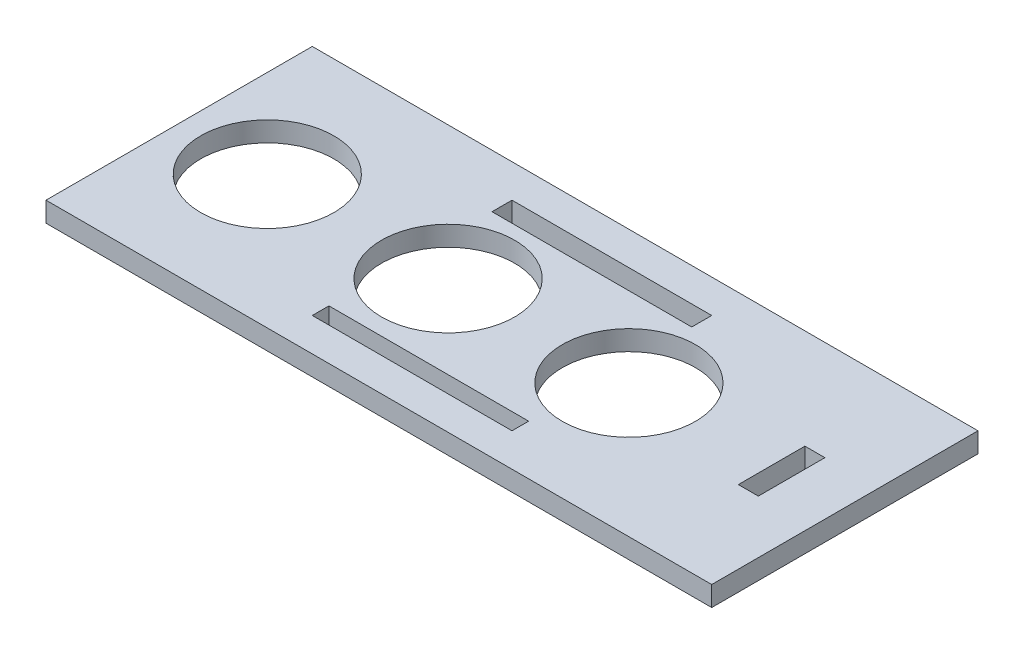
ISO-10303-21;
HEADER;
FILE_DESCRIPTION(('STEP AP214'),'2;1');
FILE_NAME('part.step','',(''),(''),'','','');
FILE_SCHEMA(('AUTOMOTIVE_DESIGN { 1 0 10303 214 1 1 1 1 }'));
ENDSEC;
DATA;
#1=APPLICATION_CONTEXT('core data for automotive mechanical design processes');
#2=APPLICATION_PROTOCOL_DEFINITION('international standard','automotive_design',2000,#1);
#3=PRODUCT_CONTEXT('',#1,'mechanical');
#4=PRODUCT('Part','Part','',(#3));
#5=PRODUCT_RELATED_PRODUCT_CATEGORY('part','',(#4));
#6=PRODUCT_DEFINITION_FORMATION('','',#4);
#7=PRODUCT_DEFINITION_CONTEXT('part definition',#1,'design');
#8=PRODUCT_DEFINITION('design','',#6,#7);
#9=PRODUCT_DEFINITION_SHAPE('','',#8);
#10=(LENGTH_UNIT() NAMED_UNIT(*) SI_UNIT(.MILLI.,.METRE.));
#11=(NAMED_UNIT(*) PLANE_ANGLE_UNIT() SI_UNIT($,.RADIAN.));
#12=(NAMED_UNIT(*) SI_UNIT($,.STERADIAN.) SOLID_ANGLE_UNIT());
#13=UNCERTAINTY_MEASURE_WITH_UNIT(LENGTH_MEASURE(1.E-05),#10,'distance_accuracy_value','');
#14=(GEOMETRIC_REPRESENTATION_CONTEXT(3) GLOBAL_UNCERTAINTY_ASSIGNED_CONTEXT((#13)) GLOBAL_UNIT_ASSIGNED_CONTEXT((#10,
#11,#12)) REPRESENTATION_CONTEXT('',''));
#15=CARTESIAN_POINT('',(0.,0.,0.));
#16=DIRECTION('',(0.,0.,1.));
#17=DIRECTION('',(1.,0.,0.));
#18=AXIS2_PLACEMENT_3D('',#15,#16,#17);
#19=CARTESIAN_POINT('',(0.,3.,0.));
#20=DIRECTION('',(0.,1.,0.));
#21=DIRECTION('',(0.,0.,1.));
#22=AXIS2_PLACEMENT_3D('',#19,#20,#21);
#23=PLANE('',#22);
#24=CARTESIAN_POINT('',(-9.59999999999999,3.,0.));
#25=DIRECTION('',(0.,1.,0.));
#26=DIRECTION('',(0.,0.,1.));
#27=AXIS2_PLACEMENT_3D('',#24,#25,#26);
#28=CIRCLE('',#27,10.);
#29=CARTESIAN_POINT('',(-9.59999999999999,3.,10.));
#30=VERTEX_POINT('',#29);
#31=EDGE_CURVE('E196',#30,#30,#28,.T.);
#32=ORIENTED_EDGE('',*,*,#31,.F.);
#33=EDGE_LOOP('',(#32));
#34=FACE_BOUND('',#33,.T.);
#35=DIRECTION('',(0.,0.,1.));
#36=VECTOR('',#35,1.);
#37=CARTESIAN_POINT('',(-15.,3.,12.5));
#38=LINE('',#37,#36);
#39=CARTESIAN_POINT('',(-15.,3.,12.5));
#40=VERTEX_POINT('',#39);
#41=CARTESIAN_POINT('',(-15.,3.,15.));
#42=VERTEX_POINT('',#41);
#43=EDGE_CURVE('E210',#40,#42,#38,.T.);
#44=ORIENTED_EDGE('',*,*,#43,.F.);
#45=DIRECTION('',(-1.,0.,0.));
#46=VECTOR('',#45,1.);
#47=CARTESIAN_POINT('',(15.,3.,12.5));
#48=LINE('',#47,#46);
#49=CARTESIAN_POINT('',(15.,3.,12.5));
#50=VERTEX_POINT('',#49);
#51=EDGE_CURVE('E208',#50,#40,#48,.T.);
#52=ORIENTED_EDGE('',*,*,#51,.F.);
#53=DIRECTION('',(0.,0.,-1.));
#54=VECTOR('',#53,1.);
#55=CARTESIAN_POINT('',(15.,3.,12.5));
#56=LINE('',#55,#54);
#57=CARTESIAN_POINT('',(14.9999999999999,3.,15.));
#58=VERTEX_POINT('',#57);
#59=EDGE_CURVE('E216',#58,#50,#56,.T.);
#60=ORIENTED_EDGE('',*,*,#59,.F.);
#61=DIRECTION('',(1.,0.,0.));
#62=VECTOR('',#61,1.);
#63=CARTESIAN_POINT('',(14.9999999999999,3.,15.));
#64=LINE('',#63,#62);
#65=EDGE_CURVE('E213',#42,#58,#64,.T.);
#66=ORIENTED_EDGE('',*,*,#65,.F.);
#67=EDGE_LOOP('',(#44,#52,#60,#66));
#68=FACE_BOUND('',#67,.T.);
#69=DIRECTION('',(1.,0.,0.));
#70=VECTOR('',#69,1.);
#71=CARTESIAN_POINT('',(15.,3.,-12.));
#72=LINE('',#71,#70);
#73=CARTESIAN_POINT('',(-15.,3.,-12.));
#74=VERTEX_POINT('',#73);
#75=CARTESIAN_POINT('',(15.,3.,-12.));
#76=VERTEX_POINT('',#75);
#77=EDGE_CURVE('E241',#74,#76,#72,.T.);
#78=ORIENTED_EDGE('',*,*,#77,.F.);
#79=DIRECTION('',(0.,0.,1.));
#80=VECTOR('',#79,1.);
#81=CARTESIAN_POINT('',(-15.,3.,-12.));
#82=LINE('',#81,#80);
#83=CARTESIAN_POINT('',(-15.,3.,-15.));
#84=VERTEX_POINT('',#83);
#85=EDGE_CURVE('E239',#84,#74,#82,.T.);
#86=ORIENTED_EDGE('',*,*,#85,.F.);
#87=DIRECTION('',(-1.,0.,0.));
#88=VECTOR('',#87,1.);
#89=CARTESIAN_POINT('',(15.,3.,-15.));
#90=LINE('',#89,#88);
#91=CARTESIAN_POINT('',(15.,3.,-15.));
#92=VERTEX_POINT('',#91);
#93=EDGE_CURVE('E247',#92,#84,#90,.T.);
#94=ORIENTED_EDGE('',*,*,#93,.F.);
#95=DIRECTION('',(0.,0.,-1.));
#96=VECTOR('',#95,1.);
#97=CARTESIAN_POINT('',(15.,3.,-12.));
#98=LINE('',#97,#96);
#99=EDGE_CURVE('E244',#76,#92,#98,.T.);
#100=ORIENTED_EDGE('',*,*,#99,.F.);
#101=EDGE_LOOP('',(#78,#86,#94,#100));
#102=FACE_BOUND('',#101,.T.);
#103=DIRECTION('',(0.,0.,1.));
#104=VECTOR('',#103,1.);
#105=CARTESIAN_POINT('',(-50.,3.,20.));
#106=LINE('',#105,#104);
#107=CARTESIAN_POINT('',(-50.,3.,-20.));
#108=VERTEX_POINT('',#107);
#109=CARTESIAN_POINT('',(-50.,3.,20.));
#110=VERTEX_POINT('',#109);
#111=EDGE_CURVE('E270',#108,#110,#106,.T.);
#112=ORIENTED_EDGE('',*,*,#111,.T.);
#113=DIRECTION('',(1.,0.,0.));
#114=VECTOR('',#113,1.);
#115=CARTESIAN_POINT('',(50.,3.,20.));
#116=LINE('',#115,#114);
#117=CARTESIAN_POINT('',(50.,3.,20.));
#118=VERTEX_POINT('',#117);
#119=EDGE_CURVE('E273',#110,#118,#116,.T.);
#120=ORIENTED_EDGE('',*,*,#119,.T.);
#121=DIRECTION('',(0.,0.,-1.));
#122=VECTOR('',#121,1.);
#123=CARTESIAN_POINT('',(50.,3.,20.));
#124=LINE('',#123,#122);
#125=CARTESIAN_POINT('',(50.,3.,-20.));
#126=VERTEX_POINT('',#125);
#127=EDGE_CURVE('E276',#118,#126,#124,.T.);
#128=ORIENTED_EDGE('',*,*,#127,.T.);
#129=DIRECTION('',(-1.,0.,0.));
#130=VECTOR('',#129,1.);
#131=CARTESIAN_POINT('',(50.,3.,-20.));
#132=LINE('',#131,#130);
#133=EDGE_CURVE('E278',#126,#108,#132,.T.);
#134=ORIENTED_EDGE('',*,*,#133,.T.);
#135=EDGE_LOOP('',(#112,#120,#128,#134));
#136=FACE_BOUND('',#135,.T.);
#137=CARTESIAN_POINT('',(-36.76,3.,0.));
#138=DIRECTION('',(0.,1.,0.));
#139=DIRECTION('',(0.,0.,1.));
#140=AXIS2_PLACEMENT_3D('',#137,#138,#139);
#141=CIRCLE('',#140,10.);
#142=CARTESIAN_POINT('',(-36.76,3.,10.));
#143=VERTEX_POINT('',#142);
#144=EDGE_CURVE('E202',#143,#143,#141,.T.);
#145=ORIENTED_EDGE('',*,*,#144,.F.);
#146=EDGE_LOOP('',(#145));
#147=FACE_BOUND('',#146,.T.);
#148=CARTESIAN_POINT('',(17.56,3.,0.));
#149=DIRECTION('',(0.,1.,0.));
#150=DIRECTION('',(0.,0.,1.));
#151=AXIS2_PLACEMENT_3D('',#148,#149,#150);
#152=CIRCLE('',#151,10.);
#153=CARTESIAN_POINT('',(17.56,3.,10.));
#154=VERTEX_POINT('',#153);
#155=EDGE_CURVE('E190',#154,#154,#152,.T.);
#156=ORIENTED_EDGE('',*,*,#155,.F.);
#157=EDGE_LOOP('',(#156));
#158=FACE_BOUND('',#157,.T.);
#159=DIRECTION('',(-1.,0.,0.));
#160=VECTOR('',#159,1.);
#161=CARTESIAN_POINT('',(39.,3.,-4.99999999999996));
#162=LINE('',#161,#160);
#163=CARTESIAN_POINT('',(42.,3.,-4.99999999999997));
#164=VERTEX_POINT('',#163);
#165=CARTESIAN_POINT('',(39.,3.,-4.99999999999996));
#166=VERTEX_POINT('',#165);
#167=EDGE_CURVE('E162',#164,#166,#162,.T.);
#168=ORIENTED_EDGE('',*,*,#167,.F.);
#169=DIRECTION('',(0.,0.,-1.));
#170=VECTOR('',#169,1.);
#171=CARTESIAN_POINT('',(42.,3.,5.));
#172=LINE('',#171,#170);
#173=CARTESIAN_POINT('',(42.,3.,5.));
#174=VERTEX_POINT('',#173);
#175=EDGE_CURVE('E154',#174,#164,#172,.T.);
#176=ORIENTED_EDGE('',*,*,#175,.F.);
#177=DIRECTION('',(1.,0.,0.));
#178=VECTOR('',#177,1.);
#179=CARTESIAN_POINT('',(39.,3.,5.00000000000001));
#180=LINE('',#179,#178);
#181=CARTESIAN_POINT('',(39.,3.,5.00000000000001));
#182=VERTEX_POINT('',#181);
#183=EDGE_CURVE('E176',#182,#174,#180,.T.);
#184=ORIENTED_EDGE('',*,*,#183,.F.);
#185=DIRECTION('',(0.,0.,1.));
#186=VECTOR('',#185,1.);
#187=CARTESIAN_POINT('',(39.,3.,5.00000000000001));
#188=LINE('',#187,#186);
#189=EDGE_CURVE('E174',#166,#182,#188,.T.);
#190=ORIENTED_EDGE('',*,*,#189,.F.);
#191=EDGE_LOOP('',(#168,#176,#184,#190));
#192=FACE_BOUND('',#191,.T.);
#193=ADVANCED_FACE('F41',(#34,#68,#102,#136,#147,#158,#192),#23,.T.);
#194=CARTESIAN_POINT('',(0.,0.,0.));
#195=DIRECTION('',(0.,1.,0.));
#196=DIRECTION('',(0.,0.,1.));
#197=AXIS2_PLACEMENT_3D('',#194,#195,#196);
#198=PLANE('',#197);
#199=CARTESIAN_POINT('',(17.56,0.,0.));
#200=DIRECTION('',(0.,1.,0.));
#201=DIRECTION('',(0.,0.,1.));
#202=AXIS2_PLACEMENT_3D('',#199,#200,#201);
#203=CIRCLE('',#202,10.);
#204=CARTESIAN_POINT('',(17.56,0.,10.));
#205=VERTEX_POINT('',#204);
#206=EDGE_CURVE('E170',#205,#205,#203,.T.);
#207=ORIENTED_EDGE('',*,*,#206,.T.);
#208=EDGE_LOOP('',(#207));
#209=FACE_BOUND('',#208,.T.);
#210=CARTESIAN_POINT('',(-9.59999999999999,0.,0.));
#211=DIRECTION('',(0.,1.,0.));
#212=DIRECTION('',(0.,0.,1.));
#213=AXIS2_PLACEMENT_3D('',#210,#211,#212);
#214=CIRCLE('',#213,10.);
#215=CARTESIAN_POINT('',(-9.59999999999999,0.,10.));
#216=VERTEX_POINT('',#215);
#217=EDGE_CURVE('E193',#216,#216,#214,.T.);
#218=ORIENTED_EDGE('',*,*,#217,.T.);
#219=EDGE_LOOP('',(#218));
#220=FACE_BOUND('',#219,.T.);
#221=CARTESIAN_POINT('',(-36.76,0.,0.));
#222=DIRECTION('',(0.,1.,0.));
#223=DIRECTION('',(0.,0.,1.));
#224=AXIS2_PLACEMENT_3D('',#221,#222,#223);
#225=CIRCLE('',#224,10.);
#226=CARTESIAN_POINT('',(-36.76,0.,10.));
#227=VERTEX_POINT('',#226);
#228=EDGE_CURVE('E199',#227,#227,#225,.T.);
#229=ORIENTED_EDGE('',*,*,#228,.T.);
#230=EDGE_LOOP('',(#229));
#231=FACE_BOUND('',#230,.T.);
#232=DIRECTION('',(-1.,0.,0.));
#233=VECTOR('',#232,1.);
#234=CARTESIAN_POINT('',(15.,0.,12.5));
#235=LINE('',#234,#233);
#236=CARTESIAN_POINT('',(15.,0.,12.5));
#237=VERTEX_POINT('',#236);
#238=CARTESIAN_POINT('',(-15.,0.,12.5));
#239=VERTEX_POINT('',#238);
#240=EDGE_CURVE('E205',#237,#239,#235,.T.);
#241=ORIENTED_EDGE('',*,*,#240,.T.);
#242=DIRECTION('',(0.,0.,1.));
#243=VECTOR('',#242,1.);
#244=CARTESIAN_POINT('',(-15.,0.,12.5));
#245=LINE('',#244,#243);
#246=CARTESIAN_POINT('',(-15.,0.,15.));
#247=VERTEX_POINT('',#246);
#248=EDGE_CURVE('E221',#239,#247,#245,.T.);
#249=ORIENTED_EDGE('',*,*,#248,.T.);
#250=DIRECTION('',(1.,0.,0.));
#251=VECTOR('',#250,1.);
#252=CARTESIAN_POINT('',(14.9999999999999,0.,15.));
#253=LINE('',#252,#251);
#254=CARTESIAN_POINT('',(14.9999999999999,0.,15.));
#255=VERTEX_POINT('',#254);
#256=EDGE_CURVE('E224',#247,#255,#253,.T.);
#257=ORIENTED_EDGE('',*,*,#256,.T.);
#258=DIRECTION('',(0.,0.,-1.));
#259=VECTOR('',#258,1.);
#260=CARTESIAN_POINT('',(15.,0.,12.5));
#261=LINE('',#260,#259);
#262=EDGE_CURVE('E211',#255,#237,#261,.T.);
#263=ORIENTED_EDGE('',*,*,#262,.T.);
#264=EDGE_LOOP('',(#241,#249,#257,#263));
#265=FACE_BOUND('',#264,.T.);
#266=DIRECTION('',(0.,0.,1.));
#267=VECTOR('',#266,1.);
#268=CARTESIAN_POINT('',(-50.,0.,20.));
#269=LINE('',#268,#267);
#270=CARTESIAN_POINT('',(-50.,0.,-20.));
#271=VERTEX_POINT('',#270);
#272=CARTESIAN_POINT('',(-50.,0.,20.));
#273=VERTEX_POINT('',#272);
#274=EDGE_CURVE('E269',#271,#273,#269,.T.);
#275=ORIENTED_EDGE('',*,*,#274,.F.);
#276=DIRECTION('',(-1.,0.,0.));
#277=VECTOR('',#276,1.);
#278=CARTESIAN_POINT('',(50.,0.,-20.));
#279=LINE('',#278,#277);
#280=CARTESIAN_POINT('',(50.,0.,-20.));
#281=VERTEX_POINT('',#280);
#282=EDGE_CURVE('E274',#281,#271,#279,.T.);
#283=ORIENTED_EDGE('',*,*,#282,.F.);
#284=DIRECTION('',(0.,0.,-1.));
#285=VECTOR('',#284,1.);
#286=CARTESIAN_POINT('',(50.,0.,20.));
#287=LINE('',#286,#285);
#288=CARTESIAN_POINT('',(50.,0.,20.));
#289=VERTEX_POINT('',#288);
#290=EDGE_CURVE('E285',#289,#281,#287,.T.);
#291=ORIENTED_EDGE('',*,*,#290,.F.);
#292=DIRECTION('',(1.,0.,0.));
#293=VECTOR('',#292,1.);
#294=CARTESIAN_POINT('',(50.,0.,20.));
#295=LINE('',#294,#293);
#296=EDGE_CURVE('E283',#273,#289,#295,.T.);
#297=ORIENTED_EDGE('',*,*,#296,.F.);
#298=EDGE_LOOP('',(#275,#283,#291,#297));
#299=FACE_BOUND('',#298,.T.);
#300=DIRECTION('',(0.,0.,1.));
#301=VECTOR('',#300,1.);
#302=CARTESIAN_POINT('',(-15.,0.,-12.));
#303=LINE('',#302,#301);
#304=CARTESIAN_POINT('',(-15.,0.,-15.));
#305=VERTEX_POINT('',#304);
#306=CARTESIAN_POINT('',(-15.,0.,-12.));
#307=VERTEX_POINT('',#306);
#308=EDGE_CURVE('E238',#305,#307,#303,.T.);
#309=ORIENTED_EDGE('',*,*,#308,.T.);
#310=DIRECTION('',(1.,0.,0.));
#311=VECTOR('',#310,1.);
#312=CARTESIAN_POINT('',(15.,0.,-12.));
#313=LINE('',#312,#311);
#314=CARTESIAN_POINT('',(15.,0.,-12.));
#315=VERTEX_POINT('',#314);
#316=EDGE_CURVE('E252',#307,#315,#313,.T.);
#317=ORIENTED_EDGE('',*,*,#316,.T.);
#318=DIRECTION('',(0.,0.,-1.));
#319=VECTOR('',#318,1.);
#320=CARTESIAN_POINT('',(15.,0.,-12.));
#321=LINE('',#320,#319);
#322=CARTESIAN_POINT('',(15.,0.,-15.));
#323=VERTEX_POINT('',#322);
#324=EDGE_CURVE('E255',#315,#323,#321,.T.);
#325=ORIENTED_EDGE('',*,*,#324,.T.);
#326=DIRECTION('',(-1.,0.,0.));
#327=VECTOR('',#326,1.);
#328=CARTESIAN_POINT('',(15.,0.,-15.));
#329=LINE('',#328,#327);
#330=EDGE_CURVE('E242',#323,#305,#329,.T.);
#331=ORIENTED_EDGE('',*,*,#330,.T.);
#332=EDGE_LOOP('',(#309,#317,#325,#331));
#333=FACE_BOUND('',#332,.T.);
#334=DIRECTION('',(0.,0.,-1.));
#335=VECTOR('',#334,1.);
#336=CARTESIAN_POINT('',(42.,0.,5.));
#337=LINE('',#336,#335);
#338=CARTESIAN_POINT('',(42.,0.,5.));
#339=VERTEX_POINT('',#338);
#340=CARTESIAN_POINT('',(42.,0.,-4.99999999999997));
#341=VERTEX_POINT('',#340);
#342=EDGE_CURVE('E64',#339,#341,#337,.T.);
#343=ORIENTED_EDGE('',*,*,#342,.T.);
#344=DIRECTION('',(-1.,0.,0.));
#345=VECTOR('',#344,1.);
#346=CARTESIAN_POINT('',(39.,0.,-4.99999999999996));
#347=LINE('',#346,#345);
#348=CARTESIAN_POINT('',(39.,0.,-4.99999999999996));
#349=VERTEX_POINT('',#348);
#350=EDGE_CURVE('E169',#341,#349,#347,.T.);
#351=ORIENTED_EDGE('',*,*,#350,.T.);
#352=DIRECTION('',(0.,0.,1.));
#353=VECTOR('',#352,1.);
#354=CARTESIAN_POINT('',(39.,0.,5.00000000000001));
#355=LINE('',#354,#353);
#356=CARTESIAN_POINT('',(39.,0.,5.00000000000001));
#357=VERTEX_POINT('',#356);
#358=EDGE_CURVE('E182',#349,#357,#355,.T.);
#359=ORIENTED_EDGE('',*,*,#358,.T.);
#360=DIRECTION('',(1.,0.,0.));
#361=VECTOR('',#360,1.);
#362=CARTESIAN_POINT('',(39.,0.,5.00000000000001));
#363=LINE('',#362,#361);
#364=EDGE_CURVE('E163',#357,#339,#363,.T.);
#365=ORIENTED_EDGE('',*,*,#364,.T.);
#366=EDGE_LOOP('',(#343,#351,#359,#365));
#367=FACE_BOUND('',#366,.T.);
#368=ADVANCED_FACE('F303',(#209,#220,#231,#265,#299,#333,#367),#198,.F.);
#369=CARTESIAN_POINT('',(-50.,3.,20.));
#370=DIRECTION('',(1.,0.,0.));
#371=DIRECTION('',(0.,0.,-1.));
#372=AXIS2_PLACEMENT_3D('',#369,#370,#371);
#373=PLANE('',#372);
#374=ORIENTED_EDGE('',*,*,#274,.T.);
#375=DIRECTION('',(0.,-1.,0.));
#376=VECTOR('',#375,1.);
#377=CARTESIAN_POINT('',(-50.,3.,20.));
#378=LINE('',#377,#376);
#379=EDGE_CURVE('E11',#110,#273,#378,.T.);
#380=ORIENTED_EDGE('',*,*,#379,.F.);
#381=ORIENTED_EDGE('',*,*,#111,.F.);
#382=DIRECTION('',(0.,-1.,0.));
#383=VECTOR('',#382,1.);
#384=CARTESIAN_POINT('',(-50.,3.,-20.));
#385=LINE('',#384,#383);
#386=EDGE_CURVE('E280',#108,#271,#385,.T.);
#387=ORIENTED_EDGE('',*,*,#386,.T.);
#388=EDGE_LOOP('',(#374,#380,#381,#387));
#389=FACE_BOUND('',#388,.T.);
#390=ADVANCED_FACE('F43',(#389),#373,.F.);
#391=CARTESIAN_POINT('',(50.,3.,20.));
#392=DIRECTION('',(0.,0.,-1.));
#393=DIRECTION('',(-1.,0.,0.));
#394=AXIS2_PLACEMENT_3D('',#391,#392,#393);
#395=PLANE('',#394);
#396=ORIENTED_EDGE('',*,*,#296,.T.);
#397=DIRECTION('',(0.,-1.,0.));
#398=VECTOR('',#397,1.);
#399=CARTESIAN_POINT('',(50.,3.,20.));
#400=LINE('',#399,#398);
#401=EDGE_CURVE('E49',#118,#289,#400,.T.);
#402=ORIENTED_EDGE('',*,*,#401,.F.);
#403=ORIENTED_EDGE('',*,*,#119,.F.);
#404=ORIENTED_EDGE('',*,*,#379,.T.);
#405=EDGE_LOOP('',(#396,#402,#403,#404));
#406=FACE_BOUND('',#405,.T.);
#407=ADVANCED_FACE('F314',(#406),#395,.F.);
#408=CARTESIAN_POINT('',(50.,3.,20.));
#409=DIRECTION('',(-1.,0.,0.));
#410=DIRECTION('',(0.,0.,1.));
#411=AXIS2_PLACEMENT_3D('',#408,#409,#410);
#412=PLANE('',#411);
#413=ORIENTED_EDGE('',*,*,#290,.T.);
#414=DIRECTION('',(0.,-1.,0.));
#415=VECTOR('',#414,1.);
#416=CARTESIAN_POINT('',(50.,3.,-20.));
#417=LINE('',#416,#415);
#418=EDGE_CURVE('E290',#126,#281,#417,.T.);
#419=ORIENTED_EDGE('',*,*,#418,.F.);
#420=ORIENTED_EDGE('',*,*,#127,.F.);
#421=ORIENTED_EDGE('',*,*,#401,.T.);
#422=EDGE_LOOP('',(#413,#419,#420,#421));
#423=FACE_BOUND('',#422,.T.);
#424=ADVANCED_FACE('F297',(#423),#412,.F.);
#425=CARTESIAN_POINT('',(50.,3.,-20.));
#426=DIRECTION('',(0.,0.,1.));
#427=DIRECTION('',(1.,0.,0.));
#428=AXIS2_PLACEMENT_3D('',#425,#426,#427);
#429=PLANE('',#428);
#430=ORIENTED_EDGE('',*,*,#282,.T.);
#431=ORIENTED_EDGE('',*,*,#386,.F.);
#432=ORIENTED_EDGE('',*,*,#133,.F.);
#433=ORIENTED_EDGE('',*,*,#418,.T.);
#434=EDGE_LOOP('',(#430,#431,#432,#433));
#435=FACE_BOUND('',#434,.T.);
#436=ADVANCED_FACE('F307',(#435),#429,.F.);
#437=CARTESIAN_POINT('',(-15.,3.,-12.));
#438=DIRECTION('',(1.,0.,0.));
#439=DIRECTION('',(0.,0.,-1.));
#440=AXIS2_PLACEMENT_3D('',#437,#438,#439);
#441=PLANE('',#440);
#442=ORIENTED_EDGE('',*,*,#308,.F.);
#443=DIRECTION('',(0.,-1.,0.));
#444=VECTOR('',#443,1.);
#445=CARTESIAN_POINT('',(-15.,3.,-15.));
#446=LINE('',#445,#444);
#447=EDGE_CURVE('E249',#84,#305,#446,.T.);
#448=ORIENTED_EDGE('',*,*,#447,.F.);
#449=ORIENTED_EDGE('',*,*,#85,.T.);
#450=DIRECTION('',(0.,-1.,0.));
#451=VECTOR('',#450,1.);
#452=CARTESIAN_POINT('',(-15.,3.,-12.));
#453=LINE('',#452,#451);
#454=EDGE_CURVE('E266',#74,#307,#453,.T.);
#455=ORIENTED_EDGE('',*,*,#454,.T.);
#456=EDGE_LOOP('',(#442,#448,#449,#455));
#457=FACE_BOUND('',#456,.T.);
#458=ADVANCED_FACE('F332',(#457),#441,.T.);
#459=CARTESIAN_POINT('',(15.,3.,-12.));
#460=DIRECTION('',(0.,0.,-1.));
#461=DIRECTION('',(-1.,0.,0.));
#462=AXIS2_PLACEMENT_3D('',#459,#460,#461);
#463=PLANE('',#462);
#464=ORIENTED_EDGE('',*,*,#316,.F.);
#465=ORIENTED_EDGE('',*,*,#454,.F.);
#466=ORIENTED_EDGE('',*,*,#77,.T.);
#467=DIRECTION('',(0.,-1.,0.));
#468=VECTOR('',#467,1.);
#469=CARTESIAN_POINT('',(15.,3.,-12.));
#470=LINE('',#469,#468);
#471=EDGE_CURVE('E264',#76,#315,#470,.T.);
#472=ORIENTED_EDGE('',*,*,#471,.T.);
#473=EDGE_LOOP('',(#464,#465,#466,#472));
#474=FACE_BOUND('',#473,.T.);
#475=ADVANCED_FACE('F339',(#474),#463,.T.);
#476=CARTESIAN_POINT('',(15.,3.,-12.));
#477=DIRECTION('',(-1.,0.,0.));
#478=DIRECTION('',(0.,0.,1.));
#479=AXIS2_PLACEMENT_3D('',#476,#477,#478);
#480=PLANE('',#479);
#481=ORIENTED_EDGE('',*,*,#324,.F.);
#482=ORIENTED_EDGE('',*,*,#471,.F.);
#483=ORIENTED_EDGE('',*,*,#99,.T.);
#484=DIRECTION('',(0.,-1.,0.));
#485=VECTOR('',#484,1.);
#486=CARTESIAN_POINT('',(15.,3.,-15.));
#487=LINE('',#486,#485);
#488=EDGE_CURVE('E262',#92,#323,#487,.T.);
#489=ORIENTED_EDGE('',*,*,#488,.T.);
#490=EDGE_LOOP('',(#481,#482,#483,#489));
#491=FACE_BOUND('',#490,.T.);
#492=ADVANCED_FACE('F344',(#491),#480,.T.);
#493=CARTESIAN_POINT('',(15.,3.,-15.));
#494=DIRECTION('',(0.,0.,1.));
#495=DIRECTION('',(1.,0.,0.));
#496=AXIS2_PLACEMENT_3D('',#493,#494,#495);
#497=PLANE('',#496);
#498=ORIENTED_EDGE('',*,*,#330,.F.);
#499=ORIENTED_EDGE('',*,*,#488,.F.);
#500=ORIENTED_EDGE('',*,*,#93,.T.);
#501=ORIENTED_EDGE('',*,*,#447,.T.);
#502=EDGE_LOOP('',(#498,#499,#500,#501));
#503=FACE_BOUND('',#502,.T.);
#504=ADVANCED_FACE('F351',(#503),#497,.T.);
#505=CARTESIAN_POINT('',(15.,3.,12.5));
#506=DIRECTION('',(0.,0.,1.));
#507=DIRECTION('',(1.,0.,0.));
#508=AXIS2_PLACEMENT_3D('',#505,#506,#507);
#509=PLANE('',#508);
#510=ORIENTED_EDGE('',*,*,#240,.F.);
#511=DIRECTION('',(0.,-1.,0.));
#512=VECTOR('',#511,1.);
#513=CARTESIAN_POINT('',(15.,3.,12.5));
#514=LINE('',#513,#512);
#515=EDGE_CURVE('E218',#50,#237,#514,.T.);
#516=ORIENTED_EDGE('',*,*,#515,.F.);
#517=ORIENTED_EDGE('',*,*,#51,.T.);
#518=DIRECTION('',(0.,-1.,0.));
#519=VECTOR('',#518,1.);
#520=CARTESIAN_POINT('',(-15.,3.,12.5));
#521=LINE('',#520,#519);
#522=EDGE_CURVE('E235',#40,#239,#521,.T.);
#523=ORIENTED_EDGE('',*,*,#522,.T.);
#524=EDGE_LOOP('',(#510,#516,#517,#523));
#525=FACE_BOUND('',#524,.T.);
#526=ADVANCED_FACE('F365',(#525),#509,.T.);
#527=CARTESIAN_POINT('',(-15.,3.,12.5));
#528=DIRECTION('',(1.,0.,0.));
#529=DIRECTION('',(0.,0.,-1.));
#530=AXIS2_PLACEMENT_3D('',#527,#528,#529);
#531=PLANE('',#530);
#532=ORIENTED_EDGE('',*,*,#248,.F.);
#533=ORIENTED_EDGE('',*,*,#522,.F.);
#534=ORIENTED_EDGE('',*,*,#43,.T.);
#535=DIRECTION('',(0.,-1.,0.));
#536=VECTOR('',#535,1.);
#537=CARTESIAN_POINT('',(-15.,3.,15.));
#538=LINE('',#537,#536);
#539=EDGE_CURVE('E233',#42,#247,#538,.T.);
#540=ORIENTED_EDGE('',*,*,#539,.T.);
#541=EDGE_LOOP('',(#532,#533,#534,#540));
#542=FACE_BOUND('',#541,.T.);
#543=ADVANCED_FACE('F370',(#542),#531,.T.);
#544=CARTESIAN_POINT('',(14.9999999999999,3.,15.));
#545=DIRECTION('',(0.,0.,-1.));
#546=DIRECTION('',(-1.,0.,0.));
#547=AXIS2_PLACEMENT_3D('',#544,#545,#546);
#548=PLANE('',#547);
#549=ORIENTED_EDGE('',*,*,#256,.F.);
#550=ORIENTED_EDGE('',*,*,#539,.F.);
#551=ORIENTED_EDGE('',*,*,#65,.T.);
#552=DIRECTION('',(0.,-1.,0.));
#553=VECTOR('',#552,1.);
#554=CARTESIAN_POINT('',(14.9999999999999,3.,15.));
#555=LINE('',#554,#553);
#556=EDGE_CURVE('E231',#58,#255,#555,.T.);
#557=ORIENTED_EDGE('',*,*,#556,.T.);
#558=EDGE_LOOP('',(#549,#550,#551,#557));
#559=FACE_BOUND('',#558,.T.);
#560=ADVANCED_FACE('F374',(#559),#548,.T.);
#561=CARTESIAN_POINT('',(15.,3.,12.5));
#562=DIRECTION('',(-1.,0.,0.));
#563=DIRECTION('',(0.,0.,1.));
#564=AXIS2_PLACEMENT_3D('',#561,#562,#563);
#565=PLANE('',#564);
#566=ORIENTED_EDGE('',*,*,#262,.F.);
#567=ORIENTED_EDGE('',*,*,#556,.F.);
#568=ORIENTED_EDGE('',*,*,#59,.T.);
#569=ORIENTED_EDGE('',*,*,#515,.T.);
#570=EDGE_LOOP('',(#566,#567,#568,#569));
#571=FACE_BOUND('',#570,.T.);
#572=ADVANCED_FACE('F378',(#571),#565,.T.);
#573=CARTESIAN_POINT('',(-36.76,3.,0.));
#574=DIRECTION('',(0.,-1.,0.));
#575=DIRECTION('',(0.,0.,-1.));
#576=AXIS2_PLACEMENT_3D('',#573,#574,#575);
#577=CYLINDRICAL_SURFACE('',#576,10.);
#578=ORIENTED_EDGE('',*,*,#144,.T.);
#579=EDGE_LOOP('',(#578));
#580=FACE_BOUND('',#579,.T.);
#581=ORIENTED_EDGE('',*,*,#228,.F.);
#582=EDGE_LOOP('',(#581));
#583=FACE_BOUND('',#582,.T.);
#584=ADVANCED_FACE('F382',(#580,#583),#577,.F.);
#585=CARTESIAN_POINT('',(-9.59999999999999,3.,0.));
#586=DIRECTION('',(0.,-1.,0.));
#587=DIRECTION('',(0.,0.,-1.));
#588=AXIS2_PLACEMENT_3D('',#585,#586,#587);
#589=CYLINDRICAL_SURFACE('',#588,10.);
#590=ORIENTED_EDGE('',*,*,#31,.T.);
#591=EDGE_LOOP('',(#590));
#592=FACE_BOUND('',#591,.T.);
#593=ORIENTED_EDGE('',*,*,#217,.F.);
#594=EDGE_LOOP('',(#593));
#595=FACE_BOUND('',#594,.T.);
#596=ADVANCED_FACE('F386',(#592,#595),#589,.F.);
#597=CARTESIAN_POINT('',(17.56,3.,0.));
#598=DIRECTION('',(0.,-1.,0.));
#599=DIRECTION('',(0.,0.,-1.));
#600=AXIS2_PLACEMENT_3D('',#597,#598,#599);
#601=CYLINDRICAL_SURFACE('',#600,10.);
#602=ORIENTED_EDGE('',*,*,#155,.T.);
#603=EDGE_LOOP('',(#602));
#604=FACE_BOUND('',#603,.T.);
#605=ORIENTED_EDGE('',*,*,#206,.F.);
#606=EDGE_LOOP('',(#605));
#607=FACE_BOUND('',#606,.T.);
#608=ADVANCED_FACE('F390',(#604,#607),#601,.F.);
#609=CARTESIAN_POINT('',(42.,3.,5.));
#610=DIRECTION('',(-1.,0.,0.));
#611=DIRECTION('',(0.,0.,1.));
#612=AXIS2_PLACEMENT_3D('',#609,#610,#611);
#613=PLANE('',#612);
#614=ORIENTED_EDGE('',*,*,#342,.F.);
#615=DIRECTION('',(0.,-1.,0.));
#616=VECTOR('',#615,1.);
#617=CARTESIAN_POINT('',(42.,3.,5.));
#618=LINE('',#617,#616);
#619=EDGE_CURVE('E158',#174,#339,#618,.T.);
#620=ORIENTED_EDGE('',*,*,#619,.F.);
#621=ORIENTED_EDGE('',*,*,#175,.T.);
#622=DIRECTION('',(0.,-1.,0.));
#623=VECTOR('',#622,1.);
#624=CARTESIAN_POINT('',(42.,3.,-4.99999999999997));
#625=LINE('',#624,#623);
#626=EDGE_CURVE('E157',#164,#341,#625,.T.);
#627=ORIENTED_EDGE('',*,*,#626,.T.);
#628=EDGE_LOOP('',(#614,#620,#621,#627));
#629=FACE_BOUND('',#628,.T.);
#630=ADVANCED_FACE('F156',(#629),#613,.T.);
#631=CARTESIAN_POINT('',(39.,3.,-4.99999999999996));
#632=DIRECTION('',(0.,0.,1.));
#633=DIRECTION('',(1.,0.,0.));
#634=AXIS2_PLACEMENT_3D('',#631,#632,#633);
#635=PLANE('',#634);
#636=ORIENTED_EDGE('',*,*,#350,.F.);
#637=ORIENTED_EDGE('',*,*,#626,.F.);
#638=ORIENTED_EDGE('',*,*,#167,.T.);
#639=DIRECTION('',(0.,-1.,0.));
#640=VECTOR('',#639,1.);
#641=CARTESIAN_POINT('',(39.,3.,-4.99999999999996));
#642=LINE('',#641,#640);
#643=EDGE_CURVE('E171',#166,#349,#642,.T.);
#644=ORIENTED_EDGE('',*,*,#643,.T.);
#645=EDGE_LOOP('',(#636,#637,#638,#644));
#646=FACE_BOUND('',#645,.T.);
#647=ADVANCED_FACE('F166',(#646),#635,.T.);
#648=CARTESIAN_POINT('',(39.,3.,5.00000000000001));
#649=DIRECTION('',(1.,0.,0.));
#650=DIRECTION('',(0.,0.,-1.));
#651=AXIS2_PLACEMENT_3D('',#648,#649,#650);
#652=PLANE('',#651);
#653=ORIENTED_EDGE('',*,*,#358,.F.);
#654=ORIENTED_EDGE('',*,*,#643,.F.);
#655=ORIENTED_EDGE('',*,*,#189,.T.);
#656=DIRECTION('',(0.,-1.,0.));
#657=VECTOR('',#656,1.);
#658=CARTESIAN_POINT('',(39.,3.,5.00000000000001));
#659=LINE('',#658,#657);
#660=EDGE_CURVE('E56',#182,#357,#659,.T.);
#661=ORIENTED_EDGE('',*,*,#660,.T.);
#662=EDGE_LOOP('',(#653,#654,#655,#661));
#663=FACE_BOUND('',#662,.T.);
#664=ADVANCED_FACE('F399',(#663),#652,.T.);
#665=CARTESIAN_POINT('',(39.,3.,5.00000000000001));
#666=DIRECTION('',(0.,0.,-1.));
#667=DIRECTION('',(-1.,0.,0.));
#668=AXIS2_PLACEMENT_3D('',#665,#666,#667);
#669=PLANE('',#668);
#670=ORIENTED_EDGE('',*,*,#364,.F.);
#671=ORIENTED_EDGE('',*,*,#660,.F.);
#672=ORIENTED_EDGE('',*,*,#183,.T.);
#673=ORIENTED_EDGE('',*,*,#619,.T.);
#674=EDGE_LOOP('',(#670,#671,#672,#673));
#675=FACE_BOUND('',#674,.T.);
#676=ADVANCED_FACE('F402',(#675),#669,.T.);
#677=CLOSED_SHELL('',(#193,#368,#390,#407,#424,#436,#458,#475,#492,#504,#526,#543,#560,#572,
#584,#596,#608,#630,#647,#664,#676));
#678=MANIFOLD_SOLID_BREP('B2',#677);
#679=ADVANCED_BREP_SHAPE_REPRESENTATION('',(#18,#678),#14);
#680=SHAPE_DEFINITION_REPRESENTATION(#9,#679);
ENDSEC;
END-ISO-10303-21;
